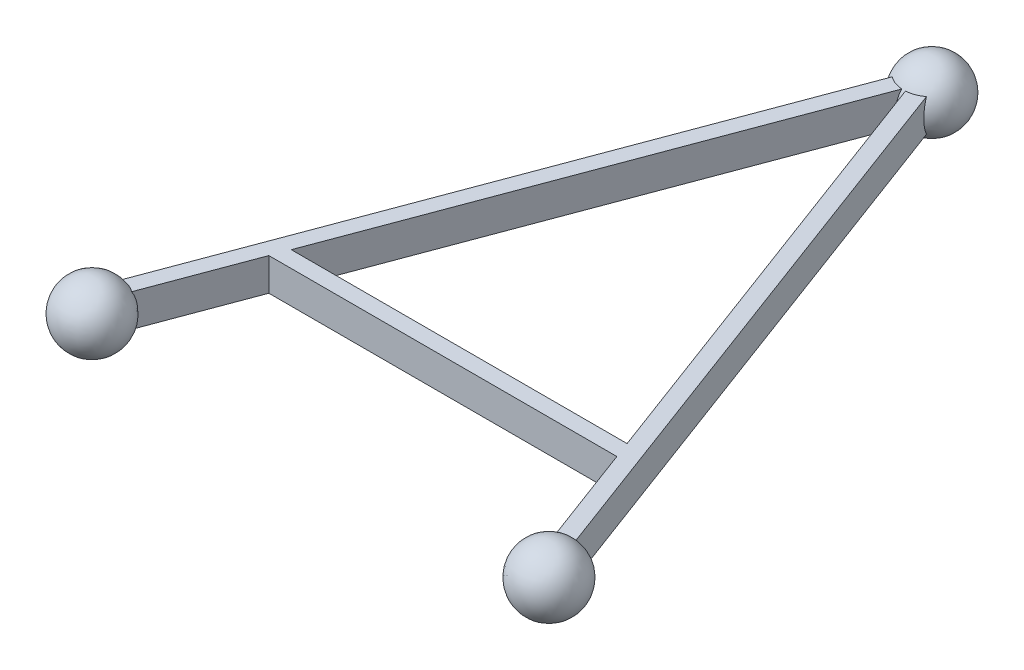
from build123d import *

# Parameters (mm, degrees)
EXTRUDE3_REACH      = 317.07
EXTRUDE3_END_RADIUS = 12.7
SKETCH8_W           = 6.35
SKETCH8_H           = 12.7
EXTRUDE4_REACH      = 317.07
EXTRUDE4_END_RADIUS = 12.7
SKETCH9_W           = 6.35
SKETCH9_H           = 12.7
EXTRUDE5_REACH      = 265.655
SKETCH10_W          = 6.35
SKETCH10_H          = 12.7


with BuildPart() as part:
    # Sketch3 → Revolve1 (revolve)
    with BuildSketch(Plane.XY):
        with BuildLine():
            Line((-177.8, 12.7), (-177.8, -12.7))
            ThreePointArc((-177.8, -12.7), (-165.1, 0), (-177.8, 12.7))
        make_face()
    revolve(axis=Axis((-177.8, 19.081718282, 0), (0, -1, 0)))



with BuildPart() as body_2:
    # Sketch4 → Revolve2 (revolve)
    with BuildSketch(Plane.XY):
        with BuildLine():
            Line((0, 12.7), (0, -12.7))
            ThreePointArc((0, -12.7), (-12.7, 0), (0, 12.7))
        make_face()
    revolve(axis=Axis((0, 22.794871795, 0), (0, -1, 0)))


with BuildPart() as body_3:
    # Sketch7 → Revolve3 (revolve)
    with BuildSketch(Plane(origin=(0, 0, 0), x_dir=(-0.34999999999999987, 0, -0.9367496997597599), z_dir=(0.9367496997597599, 0, -0.34999999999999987))):
        with BuildLine():
            Line((254, 12.7), (254, -12.7))
            ThreePointArc((254, -12.7), (241.3, 0), (254, 12.7))
        make_face()
    revolve(axis=Axis((-88.9, -33.24079005, -237.934423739), (0, 1, 0)))


with BuildPart() as part_1:
    add(part.part)

    add(body_3.part)  # Extrude3 merges body 3
    # Extrude3: up to this sphere (the profile starts outside it)
    extrude3_end = Location((-88.9, 0, -237.934423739)) * Sphere(EXTRUDE3_END_RADIUS, mode=Mode.PRIVATE)
    # Sketch8 → Extrude3 (add, up to the surface)
    with BuildSketch(Plane(origin=(-177.8, 0, 0), x_dir=(0.9367496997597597, 0, 0.3499999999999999), z_dir=(-0.3499999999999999, 0, 0.9367496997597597)), mode=Mode.PRIVATE) as extrude3_sk1:
        Rectangle(SKETCH8_W, SKETCH8_H)
    extrude3_tool1 = extrude(extrude3_sk1.sketch, amount=-EXTRUDE3_REACH, mode=Mode.PRIVATE) - extrude3_end
    add(extrude3_tool1.solids().sort_by_distance((-177.8, 0, 0))[0])


    add(body_2.part)  # Extrude4 merges body 2
    # Extrude4: up to this sphere (the profile starts outside it)
    extrude4_end = Location((-88.9, 0, -237.934423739)) * Sphere(EXTRUDE4_END_RADIUS, mode=Mode.PRIVATE)
    # Sketch9 → Extrude4 (add, up to the surface)
    with BuildSketch(Plane(origin=(0, 0, 0), x_dir=(-0.9367496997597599, 0, 0.35), z_dir=(-0.35, 0, -0.9367496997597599)), mode=Mode.PRIVATE) as extrude4_sk1:
        Rectangle(SKETCH9_W, SKETCH9_H)
    extrude4_tool1 = extrude(extrude4_sk1.sketch, amount=EXTRUDE4_REACH, mode=Mode.PRIVATE) - extrude4_end
    add(extrude4_tool1.solids().sort_by_distance((0, 0, 0))[0])

    # Extrude5: up to this plane
    extrude5_end = Plane(origin=(-69.315516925, 6.35, -281.279448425), z_dir=(0.9367496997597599, 0, 0.3499999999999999))
    # Sketch10 → Extrude5 (add, up to the surface)
    with BuildSketch(Plane(origin=(-18.980523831, 0, -50.8), x_dir=(0, 0, -1), z_dir=(1, 0, 0)), mode=Mode.PRIVATE) as extrude5_sk1:
        Rectangle(SKETCH10_W, SKETCH10_H)
    extrude5_tool1 = split(extrude(extrude5_sk1.sketch, amount=-EXTRUDE5_REACH, mode=Mode.PRIVATE), bisect_by=extrude5_end, keep=Keep.BOTH, mode=Mode.PRIVATE)
    add(extrude5_tool1.solids().sort_by_distance((-18.980524, 0, -50.8))[0])


solid = part_1.part
